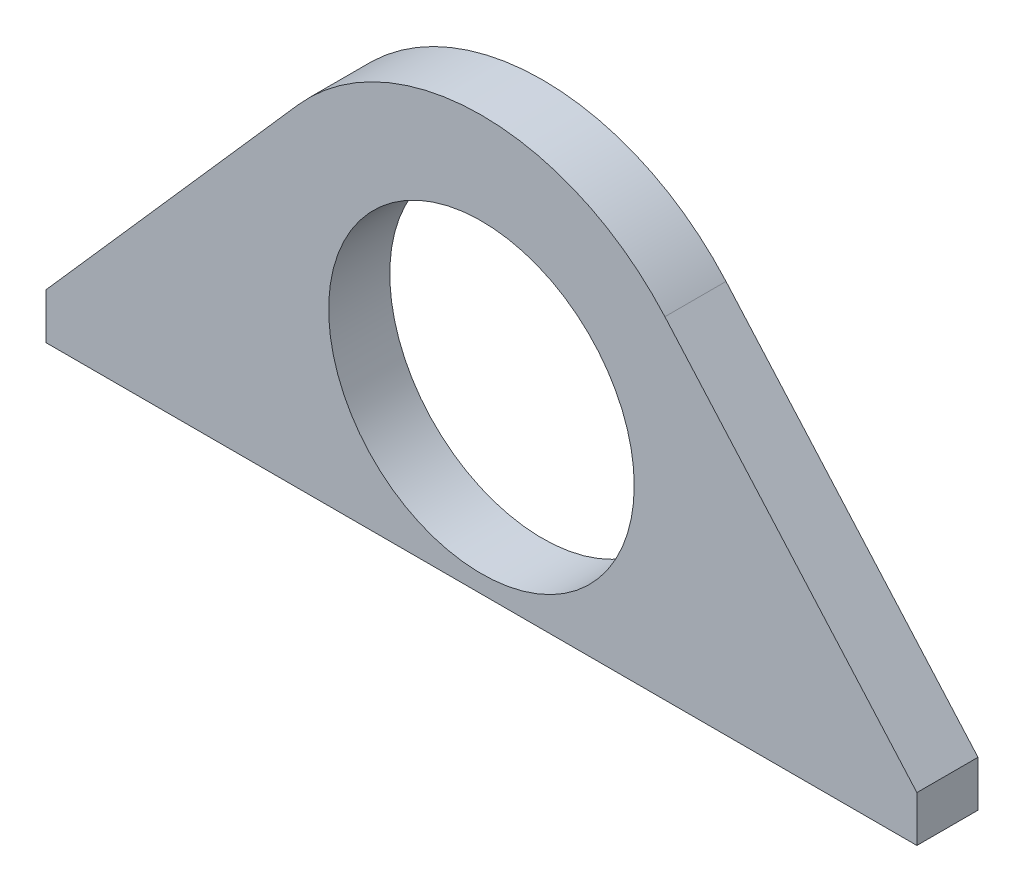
ISO-10303-21;
HEADER;
FILE_DESCRIPTION(('STEP AP214'),'2;1');
FILE_NAME('part.step','',(''),(''),'','','');
FILE_SCHEMA(('AUTOMOTIVE_DESIGN { 1 0 10303 214 1 1 1 1 }'));
ENDSEC;
DATA;
#1=APPLICATION_CONTEXT('core data for automotive mechanical design processes');
#2=APPLICATION_PROTOCOL_DEFINITION('international standard','automotive_design',2000,#1);
#3=PRODUCT_CONTEXT('',#1,'mechanical');
#4=PRODUCT('Part','Part','',(#3));
#5=PRODUCT_RELATED_PRODUCT_CATEGORY('part','',(#4));
#6=PRODUCT_DEFINITION_FORMATION('','',#4);
#7=PRODUCT_DEFINITION_CONTEXT('part definition',#1,'design');
#8=PRODUCT_DEFINITION('design','',#6,#7);
#9=PRODUCT_DEFINITION_SHAPE('','',#8);
#10=(LENGTH_UNIT() NAMED_UNIT(*) SI_UNIT(.MILLI.,.METRE.));
#11=(NAMED_UNIT(*) PLANE_ANGLE_UNIT() SI_UNIT($,.RADIAN.));
#12=(NAMED_UNIT(*) SI_UNIT($,.STERADIAN.) SOLID_ANGLE_UNIT());
#13=UNCERTAINTY_MEASURE_WITH_UNIT(LENGTH_MEASURE(1.E-05),#10,'distance_accuracy_value','');
#14=(GEOMETRIC_REPRESENTATION_CONTEXT(3) GLOBAL_UNCERTAINTY_ASSIGNED_CONTEXT((#13)) GLOBAL_UNIT_ASSIGNED_CONTEXT((#10,
#11,#12)) REPRESENTATION_CONTEXT('',''));
#15=CARTESIAN_POINT('',(0.,0.,0.));
#16=DIRECTION('',(0.,0.,1.));
#17=DIRECTION('',(1.,0.,0.));
#18=AXIS2_PLACEMENT_3D('',#15,#16,#17);
#19=CARTESIAN_POINT('',(0.,0.,8.));
#20=DIRECTION('',(0.,0.,-1.));
#21=DIRECTION('',(-1.,0.,0.));
#22=AXIS2_PLACEMENT_3D('',#19,#20,#21);
#23=PLANE('',#22);
#24=DIRECTION('',(1.,0.,0.));
#25=VECTOR('',#24,1.);
#26=CARTESIAN_POINT('',(57.,-22.3,8.));
#27=LINE('',#26,#25);
#28=CARTESIAN_POINT('',(-57.,-22.3,8.));
#29=VERTEX_POINT('',#28);
#30=CARTESIAN_POINT('',(57.,-22.3,8.));
#31=VERTEX_POINT('',#30);
#32=EDGE_CURVE('E116',#29,#31,#27,.T.);
#33=ORIENTED_EDGE('',*,*,#32,.T.);
#34=DIRECTION('',(0.,1.,0.));
#35=VECTOR('',#34,1.);
#36=CARTESIAN_POINT('',(57.,-22.3,8.));
#37=LINE('',#36,#35);
#38=CARTESIAN_POINT('',(57.,-16.3,8.));
#39=VERTEX_POINT('',#38);
#40=EDGE_CURVE('E97',#31,#39,#37,.T.);
#41=ORIENTED_EDGE('',*,*,#40,.T.);
#42=DIRECTION('',(-0.66096536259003,0.75041641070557,0.));
#43=VECTOR('',#42,1.);
#44=CARTESIAN_POINT('',(57.,-16.3,8.));
#45=LINE('',#44,#43);
#46=CARTESIAN_POINT('',(24.0133251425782,21.150891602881,8.));
#47=VERTEX_POINT('',#46);
#48=EDGE_CURVE('E119',#39,#47,#45,.T.);
#49=ORIENTED_EDGE('',*,*,#48,.T.);
#50=CARTESIAN_POINT('',(0.,0.,8.));
#51=DIRECTION('',(0.,0.,1.));
#52=DIRECTION('',(1.,0.,0.));
#53=AXIS2_PLACEMENT_3D('',#50,#51,#52);
#54=CIRCLE('',#53,32.);
#55=CARTESIAN_POINT('',(-24.0133251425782,21.1508916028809,8.));
#56=VERTEX_POINT('',#55);
#57=EDGE_CURVE('E121',#47,#56,#54,.T.);
#58=ORIENTED_EDGE('',*,*,#57,.T.);
#59=DIRECTION('',(-0.66096536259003,-0.75041641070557,0.));
#60=VECTOR('',#59,1.);
#61=CARTESIAN_POINT('',(-57.,-16.3,8.));
#62=LINE('',#61,#60);
#63=CARTESIAN_POINT('',(-57.,-16.3,8.));
#64=VERTEX_POINT('',#63);
#65=EDGE_CURVE('E50',#56,#64,#62,.T.);
#66=ORIENTED_EDGE('',*,*,#65,.T.);
#67=DIRECTION('',(0.,-1.,0.));
#68=VECTOR('',#67,1.);
#69=CARTESIAN_POINT('',(-57.,-22.3,8.));
#70=LINE('',#69,#68);
#71=EDGE_CURVE('E45',#64,#29,#70,.T.);
#72=ORIENTED_EDGE('',*,*,#71,.T.);
#73=EDGE_LOOP('',(#33,#41,#49,#58,#66,#72));
#74=FACE_BOUND('',#73,.T.);
#75=CARTESIAN_POINT('',(0.,0.,8.));
#76=DIRECTION('',(0.,0.,1.));
#77=DIRECTION('',(1.,0.,0.));
#78=AXIS2_PLACEMENT_3D('',#75,#76,#77);
#79=CIRCLE('',#78,20.);
#80=CARTESIAN_POINT('',(20.,0.,8.));
#81=VERTEX_POINT('',#80);
#82=EDGE_CURVE('E102',#81,#81,#79,.T.);
#83=ORIENTED_EDGE('',*,*,#82,.F.);
#84=EDGE_LOOP('',(#83));
#85=FACE_BOUND('',#84,.T.);
#86=ADVANCED_FACE('F30',(#74,#85),#23,.F.);
#87=CARTESIAN_POINT('',(0.,0.,0.));
#88=DIRECTION('',(0.,0.,-1.));
#89=DIRECTION('',(-1.,0.,0.));
#90=AXIS2_PLACEMENT_3D('',#87,#88,#89);
#91=PLANE('',#90);
#92=DIRECTION('',(1.,0.,0.));
#93=VECTOR('',#92,1.);
#94=CARTESIAN_POINT('',(57.,-22.3,0.));
#95=LINE('',#94,#93);
#96=CARTESIAN_POINT('',(-57.,-22.3,0.));
#97=VERTEX_POINT('',#96);
#98=CARTESIAN_POINT('',(57.,-22.3,0.));
#99=VERTEX_POINT('',#98);
#100=EDGE_CURVE('E88',#97,#99,#95,.T.);
#101=ORIENTED_EDGE('',*,*,#100,.F.);
#102=DIRECTION('',(0.,-1.,0.));
#103=VECTOR('',#102,1.);
#104=CARTESIAN_POINT('',(-57.,-22.3,0.));
#105=LINE('',#104,#103);
#106=CARTESIAN_POINT('',(-57.,-16.3,0.));
#107=VERTEX_POINT('',#106);
#108=EDGE_CURVE('E114',#107,#97,#105,.T.);
#109=ORIENTED_EDGE('',*,*,#108,.F.);
#110=DIRECTION('',(-0.66096536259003,-0.75041641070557,0.));
#111=VECTOR('',#110,1.);
#112=CARTESIAN_POINT('',(-57.,-16.3,0.));
#113=LINE('',#112,#111);
#114=CARTESIAN_POINT('',(-24.0133251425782,21.1508916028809,0.));
#115=VERTEX_POINT('',#114);
#116=EDGE_CURVE('E112',#115,#107,#113,.T.);
#117=ORIENTED_EDGE('',*,*,#116,.F.);
#118=CARTESIAN_POINT('',(0.,0.,0.));
#119=DIRECTION('',(0.,0.,1.));
#120=DIRECTION('',(-1.,0.,0.));
#121=AXIS2_PLACEMENT_3D('',#118,#119,#120);
#122=CIRCLE('',#121,32.);
#123=CARTESIAN_POINT('',(24.0133251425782,21.150891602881,0.));
#124=VERTEX_POINT('',#123);
#125=EDGE_CURVE('E110',#124,#115,#122,.T.);
#126=ORIENTED_EDGE('',*,*,#125,.F.);
#127=DIRECTION('',(-0.66096536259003,0.75041641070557,0.));
#128=VECTOR('',#127,1.);
#129=CARTESIAN_POINT('',(57.,-16.3,0.));
#130=LINE('',#129,#128);
#131=CARTESIAN_POINT('',(57.,-16.3,0.));
#132=VERTEX_POINT('',#131);
#133=EDGE_CURVE('E90',#132,#124,#130,.T.);
#134=ORIENTED_EDGE('',*,*,#133,.F.);
#135=DIRECTION('',(0.,1.,0.));
#136=VECTOR('',#135,1.);
#137=CARTESIAN_POINT('',(57.,-22.3,0.));
#138=LINE('',#137,#136);
#139=EDGE_CURVE('E83',#99,#132,#138,.T.);
#140=ORIENTED_EDGE('',*,*,#139,.F.);
#141=EDGE_LOOP('',(#101,#109,#117,#126,#134,#140));
#142=FACE_BOUND('',#141,.T.);
#143=CARTESIAN_POINT('',(0.,0.,0.));
#144=DIRECTION('',(0.,0.,1.));
#145=DIRECTION('',(1.,0.,0.));
#146=AXIS2_PLACEMENT_3D('',#143,#144,#145);
#147=CIRCLE('',#146,20.);
#148=CARTESIAN_POINT('',(20.,0.,0.));
#149=VERTEX_POINT('',#148);
#150=EDGE_CURVE('E105',#149,#149,#147,.T.);
#151=ORIENTED_EDGE('',*,*,#150,.T.);
#152=EDGE_LOOP('',(#151));
#153=FACE_BOUND('',#152,.T.);
#154=ADVANCED_FACE('F84',(#142,#153),#91,.T.);
#155=CARTESIAN_POINT('',(57.,-22.3,8.));
#156=DIRECTION('',(0.,1.,0.));
#157=DIRECTION('',(-1.,0.,0.));
#158=AXIS2_PLACEMENT_3D('',#155,#156,#157);
#159=PLANE('',#158);
#160=ORIENTED_EDGE('',*,*,#100,.T.);
#161=DIRECTION('',(0.,0.,-1.));
#162=VECTOR('',#161,1.);
#163=CARTESIAN_POINT('',(57.,-22.3,8.));
#164=LINE('',#163,#162);
#165=EDGE_CURVE('E11',#31,#99,#164,.T.);
#166=ORIENTED_EDGE('',*,*,#165,.F.);
#167=ORIENTED_EDGE('',*,*,#32,.F.);
#168=DIRECTION('',(0.,0.,-1.));
#169=VECTOR('',#168,1.);
#170=CARTESIAN_POINT('',(-57.,-22.3,8.));
#171=LINE('',#170,#169);
#172=EDGE_CURVE('E101',#29,#97,#171,.T.);
#173=ORIENTED_EDGE('',*,*,#172,.T.);
#174=EDGE_LOOP('',(#160,#166,#167,#173));
#175=FACE_BOUND('',#174,.T.);
#176=ADVANCED_FACE('F32',(#175),#159,.F.);
#177=CARTESIAN_POINT('',(57.,-22.3,8.));
#178=DIRECTION('',(-1.,0.,0.));
#179=DIRECTION('',(0.,-1.,0.));
#180=AXIS2_PLACEMENT_3D('',#177,#178,#179);
#181=PLANE('',#180);
#182=ORIENTED_EDGE('',*,*,#139,.T.);
#183=DIRECTION('',(0.,0.,-1.));
#184=VECTOR('',#183,1.);
#185=CARTESIAN_POINT('',(57.,-16.3,8.));
#186=LINE('',#185,#184);
#187=EDGE_CURVE('E38',#39,#132,#186,.T.);
#188=ORIENTED_EDGE('',*,*,#187,.F.);
#189=ORIENTED_EDGE('',*,*,#40,.F.);
#190=ORIENTED_EDGE('',*,*,#165,.T.);
#191=EDGE_LOOP('',(#182,#188,#189,#190));
#192=FACE_BOUND('',#191,.T.);
#193=ADVANCED_FACE('F96',(#192),#181,.F.);
#194=CARTESIAN_POINT('',(57.,-16.3,8.));
#195=DIRECTION('',(-0.75041641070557,-0.66096536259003,0.));
#196=DIRECTION('',(0.66096536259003,-0.75041641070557,0.));
#197=AXIS2_PLACEMENT_3D('',#194,#195,#196);
#198=PLANE('',#197);
#199=ORIENTED_EDGE('',*,*,#133,.T.);
#200=DIRECTION('',(0.,0.,-1.));
#201=VECTOR('',#200,1.);
#202=CARTESIAN_POINT('',(24.0133251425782,21.150891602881,8.));
#203=LINE('',#202,#201);
#204=EDGE_CURVE('E132',#47,#124,#203,.T.);
#205=ORIENTED_EDGE('',*,*,#204,.F.);
#206=ORIENTED_EDGE('',*,*,#48,.F.);
#207=ORIENTED_EDGE('',*,*,#187,.T.);
#208=EDGE_LOOP('',(#199,#205,#206,#207));
#209=FACE_BOUND('',#208,.T.);
#210=ADVANCED_FACE('F136',(#209),#198,.F.);
#211=CARTESIAN_POINT('',(0.,0.,8.));
#212=DIRECTION('',(0.,0.,-1.));
#213=DIRECTION('',(-1.,0.,0.));
#214=AXIS2_PLACEMENT_3D('',#211,#212,#213);
#215=CYLINDRICAL_SURFACE('',#214,32.);
#216=ORIENTED_EDGE('',*,*,#125,.T.);
#217=DIRECTION('',(0.,0.,-1.));
#218=VECTOR('',#217,1.);
#219=CARTESIAN_POINT('',(-24.0133251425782,21.1508916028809,8.));
#220=LINE('',#219,#218);
#221=EDGE_CURVE('E129',#56,#115,#220,.T.);
#222=ORIENTED_EDGE('',*,*,#221,.F.);
#223=ORIENTED_EDGE('',*,*,#57,.F.);
#224=ORIENTED_EDGE('',*,*,#204,.T.);
#225=EDGE_LOOP('',(#216,#222,#223,#224));
#226=FACE_BOUND('',#225,.T.);
#227=ADVANCED_FACE('F142',(#226),#215,.T.);
#228=CARTESIAN_POINT('',(-57.,-16.3,8.));
#229=DIRECTION('',(0.75041641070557,-0.66096536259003,0.));
#230=DIRECTION('',(0.66096536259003,0.75041641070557,0.));
#231=AXIS2_PLACEMENT_3D('',#228,#229,#230);
#232=PLANE('',#231);
#233=ORIENTED_EDGE('',*,*,#116,.T.);
#234=DIRECTION('',(0.,0.,-1.));
#235=VECTOR('',#234,1.);
#236=CARTESIAN_POINT('',(-57.,-16.3,8.));
#237=LINE('',#236,#235);
#238=EDGE_CURVE('E126',#64,#107,#237,.T.);
#239=ORIENTED_EDGE('',*,*,#238,.F.);
#240=ORIENTED_EDGE('',*,*,#65,.F.);
#241=ORIENTED_EDGE('',*,*,#221,.T.);
#242=EDGE_LOOP('',(#233,#239,#240,#241));
#243=FACE_BOUND('',#242,.T.);
#244=ADVANCED_FACE('F145',(#243),#232,.F.);
#245=CARTESIAN_POINT('',(-57.,-22.3,8.));
#246=DIRECTION('',(1.,0.,0.));
#247=DIRECTION('',(0.,1.,0.));
#248=AXIS2_PLACEMENT_3D('',#245,#246,#247);
#249=PLANE('',#248);
#250=ORIENTED_EDGE('',*,*,#108,.T.);
#251=ORIENTED_EDGE('',*,*,#172,.F.);
#252=ORIENTED_EDGE('',*,*,#71,.F.);
#253=ORIENTED_EDGE('',*,*,#238,.T.);
#254=EDGE_LOOP('',(#250,#251,#252,#253));
#255=FACE_BOUND('',#254,.T.);
#256=ADVANCED_FACE('F147',(#255),#249,.F.);
#257=CARTESIAN_POINT('',(0.,0.,8.));
#258=DIRECTION('',(0.,0.,-1.));
#259=DIRECTION('',(-1.,0.,0.));
#260=AXIS2_PLACEMENT_3D('',#257,#258,#259);
#261=CYLINDRICAL_SURFACE('',#260,20.);
#262=ORIENTED_EDGE('',*,*,#82,.T.);
#263=EDGE_LOOP('',(#262));
#264=FACE_BOUND('',#263,.T.);
#265=ORIENTED_EDGE('',*,*,#150,.F.);
#266=EDGE_LOOP('',(#265));
#267=FACE_BOUND('',#266,.T.);
#268=ADVANCED_FACE('F149',(#264,#267),#261,.F.);
#269=CLOSED_SHELL('',(#86,#154,#176,#193,#210,#227,#244,#256,#268));
#270=MANIFOLD_SOLID_BREP('B2',#269);
#271=ADVANCED_BREP_SHAPE_REPRESENTATION('',(#18,#270),#14);
#272=SHAPE_DEFINITION_REPRESENTATION(#9,#271);
ENDSEC;
END-ISO-10303-21;
